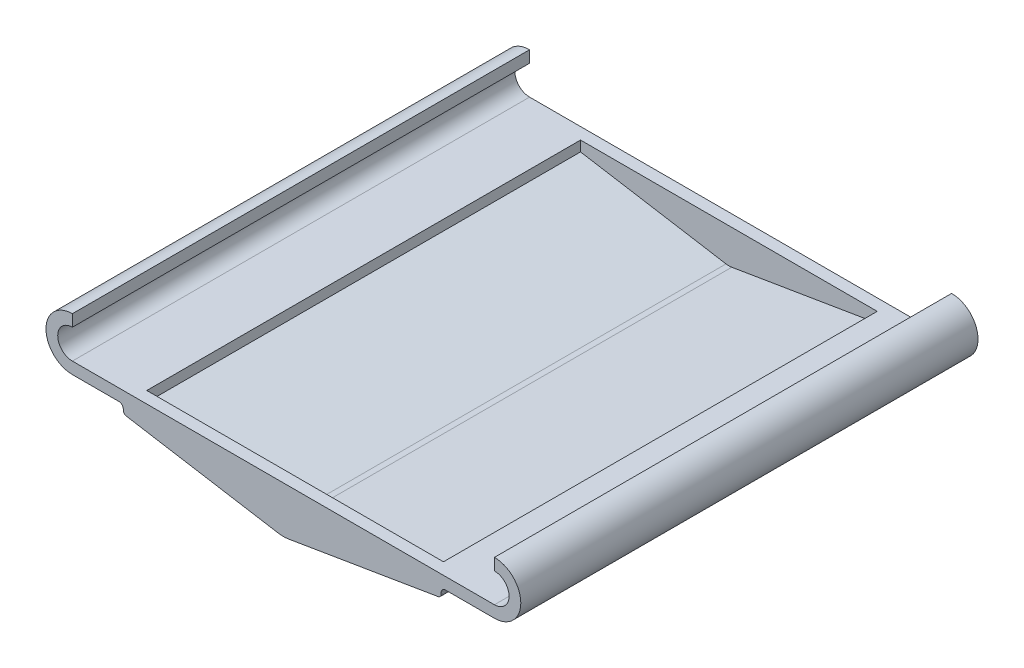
ISO-10303-21;
HEADER;
FILE_DESCRIPTION(('STEP AP214'),'2;1');
FILE_NAME('part.step','',(''),(''),'','','');
FILE_SCHEMA(('AUTOMOTIVE_DESIGN { 1 0 10303 214 1 1 1 1 }'));
ENDSEC;
DATA;
#1=APPLICATION_CONTEXT('core data for automotive mechanical design processes');
#2=APPLICATION_PROTOCOL_DEFINITION('international standard','automotive_design',2000,#1);
#3=PRODUCT_CONTEXT('',#1,'mechanical');
#4=PRODUCT('Part','Part','',(#3));
#5=PRODUCT_RELATED_PRODUCT_CATEGORY('part','',(#4));
#6=PRODUCT_DEFINITION_FORMATION('','',#4);
#7=PRODUCT_DEFINITION_CONTEXT('part definition',#1,'design');
#8=PRODUCT_DEFINITION('design','',#6,#7);
#9=PRODUCT_DEFINITION_SHAPE('','',#8);
#10=(LENGTH_UNIT() NAMED_UNIT(*) SI_UNIT(.MILLI.,.METRE.));
#11=(NAMED_UNIT(*) PLANE_ANGLE_UNIT() SI_UNIT($,.RADIAN.));
#12=(NAMED_UNIT(*) SI_UNIT($,.STERADIAN.) SOLID_ANGLE_UNIT());
#13=UNCERTAINTY_MEASURE_WITH_UNIT(LENGTH_MEASURE(1.E-05),#10,'distance_accuracy_value','');
#14=(GEOMETRIC_REPRESENTATION_CONTEXT(3) GLOBAL_UNCERTAINTY_ASSIGNED_CONTEXT((#13)) GLOBAL_UNIT_ASSIGNED_CONTEXT((#10,
#11,#12)) REPRESENTATION_CONTEXT('',''));
#15=CARTESIAN_POINT('',(0.,0.,0.));
#16=DIRECTION('',(0.,0.,1.));
#17=DIRECTION('',(1.,0.,0.));
#18=AXIS2_PLACEMENT_3D('',#15,#16,#17);
#19=CARTESIAN_POINT('',(-8.,-39.,19.5));
#20=DIRECTION('',(0.,-1.,0.));
#21=DIRECTION('',(1.,0.,0.));
#22=AXIS2_PLACEMENT_3D('',#19,#20,#21);
#23=PLANE('',#22);
#24=DIRECTION('',(-1.,0.,0.));
#25=VECTOR('',#24,1.);
#26=CARTESIAN_POINT('',(-8.,-39.,-19.4999999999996));
#27=LINE('',#26,#25);
#28=CARTESIAN_POINT('',(28.,-39.,-19.4999999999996));
#29=VERTEX_POINT('',#28);
#30=CARTESIAN_POINT('',(-8.,-39.,-19.4999999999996));
#31=VERTEX_POINT('',#30);
#32=EDGE_CURVE('E315',#29,#31,#27,.T.);
#33=ORIENTED_EDGE('',*,*,#32,.T.);
#34=DIRECTION('',(0.,0.,-1.));
#35=VECTOR('',#34,1.);
#36=CARTESIAN_POINT('',(-8.,-39.,19.5));
#37=LINE('',#36,#35);
#38=CARTESIAN_POINT('',(-8.,-39.,19.5));
#39=VERTEX_POINT('',#38);
#40=EDGE_CURVE('E336',#39,#31,#37,.T.);
#41=ORIENTED_EDGE('',*,*,#40,.F.);
#42=DIRECTION('',(-1.,0.,0.));
#43=VECTOR('',#42,1.);
#44=CARTESIAN_POINT('',(-8.,-39.,19.5));
#45=LINE('',#44,#43);
#46=CARTESIAN_POINT('',(28.,-39.,19.5));
#47=VERTEX_POINT('',#46);
#48=EDGE_CURVE('E334',#47,#39,#45,.T.);
#49=ORIENTED_EDGE('',*,*,#48,.F.);
#50=DIRECTION('',(0.,0.,-1.));
#51=VECTOR('',#50,1.);
#52=CARTESIAN_POINT('',(28.,-39.,19.5));
#53=LINE('',#52,#51);
#54=EDGE_CURVE('E339',#47,#29,#53,.T.);
#55=ORIENTED_EDGE('',*,*,#54,.T.);
#56=EDGE_LOOP('',(#33,#41,#49,#55));
#57=FACE_BOUND('',#56,.T.);
#58=DIRECTION('',(-1.,0.,0.));
#59=VECTOR('',#58,1.);
#60=CARTESIAN_POINT('',(22.6544570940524,-39.,-18.4999999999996));
#61=LINE('',#60,#59);
#62=CARTESIAN_POINT('',(22.6544570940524,-39.,-18.4999999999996));
#63=VERTEX_POINT('',#62);
#64=CARTESIAN_POINT('',(-2.65445709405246,-39.,-18.4999999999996));
#65=VERTEX_POINT('',#64);
#66=EDGE_CURVE('E224',#63,#65,#61,.T.);
#67=ORIENTED_EDGE('',*,*,#66,.F.);
#68=DIRECTION('',(0.,0.,1.));
#69=VECTOR('',#68,1.);
#70=CARTESIAN_POINT('',(22.6544570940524,-39.,-18.4999999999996));
#71=LINE('',#70,#69);
#72=CARTESIAN_POINT('',(22.6544570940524,-39.,18.5));
#73=VERTEX_POINT('',#72);
#74=EDGE_CURVE('E238',#63,#73,#71,.T.);
#75=ORIENTED_EDGE('',*,*,#74,.T.);
#76=DIRECTION('',(-1.,0.,0.));
#77=VECTOR('',#76,1.);
#78=CARTESIAN_POINT('',(22.6544570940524,-39.,18.5));
#79=LINE('',#78,#77);
#80=CARTESIAN_POINT('',(-2.65445709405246,-39.,18.5));
#81=VERTEX_POINT('',#80);
#82=EDGE_CURVE('E212',#73,#81,#79,.T.);
#83=ORIENTED_EDGE('',*,*,#82,.T.);
#84=DIRECTION('',(0.,0.,1.));
#85=VECTOR('',#84,1.);
#86=CARTESIAN_POINT('',(-2.65445709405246,-39.,-18.4999999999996));
#87=LINE('',#86,#85);
#88=EDGE_CURVE('E236',#65,#81,#87,.T.);
#89=ORIENTED_EDGE('',*,*,#88,.F.);
#90=EDGE_LOOP('',(#67,#75,#83,#89));
#91=FACE_BOUND('',#90,.T.);
#92=ADVANCED_FACE('F24',(#57,#91),#23,.F.);
#93=CARTESIAN_POINT('',(-8.,-40.,19.5));
#94=DIRECTION('',(0.,1.,0.));
#95=DIRECTION('',(-1.,0.,0.));
#96=AXIS2_PLACEMENT_3D('',#93,#94,#95);
#97=PLANE('',#96);
#98=DIRECTION('',(0.,0.,-1.));
#99=VECTOR('',#98,1.);
#100=CARTESIAN_POINT('',(-4.03413135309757,-40.,19.5));
#101=LINE('',#100,#99);
#102=CARTESIAN_POINT('',(-4.03413135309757,-40.,19.5));
#103=VERTEX_POINT('',#102);
#104=CARTESIAN_POINT('',(-4.03413135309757,-40.0000000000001,-19.4999999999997));
#105=VERTEX_POINT('',#104);
#106=EDGE_CURVE('E284',#103,#105,#101,.T.);
#107=ORIENTED_EDGE('',*,*,#106,.F.);
#108=DIRECTION('',(1.,0.,0.));
#109=VECTOR('',#108,1.);
#110=CARTESIAN_POINT('',(-8.,-40.,19.5));
#111=LINE('',#110,#109);
#112=CARTESIAN_POINT('',(-8.,-40.,19.5));
#113=VERTEX_POINT('',#112);
#114=EDGE_CURVE('E325',#113,#103,#111,.T.);
#115=ORIENTED_EDGE('',*,*,#114,.F.);
#116=DIRECTION('',(0.,0.,-1.));
#117=VECTOR('',#116,1.);
#118=CARTESIAN_POINT('',(-8.,-40.,19.5));
#119=LINE('',#118,#117);
#120=CARTESIAN_POINT('',(-8.,-40.0000000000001,-19.4999999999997));
#121=VERTEX_POINT('',#120);
#122=EDGE_CURVE('E351',#113,#121,#119,.T.);
#123=ORIENTED_EDGE('',*,*,#122,.T.);
#124=DIRECTION('',(1.,0.,0.));
#125=VECTOR('',#124,1.);
#126=CARTESIAN_POINT('',(-8.,-40.0000000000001,-19.4999999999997));
#127=LINE('',#126,#125);
#128=EDGE_CURVE('E307',#121,#105,#127,.T.);
#129=ORIENTED_EDGE('',*,*,#128,.T.);
#130=EDGE_LOOP('',(#107,#115,#123,#129));
#131=FACE_BOUND('',#130,.T.);
#132=ADVANCED_FACE('F435',(#131),#97,.F.);
#133=CARTESIAN_POINT('',(-8.,-37.7500000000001,19.5000000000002));
#134=DIRECTION('',(0.,0.,-1.));
#135=DIRECTION('',(-1.,0.,0.));
#136=AXIS2_PLACEMENT_3D('',#133,#134,#135);
#137=CYLINDRICAL_SURFACE('',#136,1.25);
#138=CARTESIAN_POINT('',(-8.,-37.75,-19.4999999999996));
#139=DIRECTION('',(0.,0.,-1.));
#140=DIRECTION('',(-1.,0.,0.));
#141=AXIS2_PLACEMENT_3D('',#138,#139,#140);
#142=CIRCLE('',#141,1.25);
#143=CARTESIAN_POINT('',(-8.,-36.5,-19.4999999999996));
#144=VERTEX_POINT('',#143);
#145=EDGE_CURVE('E299',#31,#144,#142,.T.);
#146=ORIENTED_EDGE('',*,*,#145,.T.);
#147=DIRECTION('',(0.,0.,-1.));
#148=VECTOR('',#147,1.);
#149=CARTESIAN_POINT('',(-8.,-36.5000000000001,19.5000000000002));
#150=LINE('',#149,#148);
#151=CARTESIAN_POINT('',(-8.,-36.5000000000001,19.5000000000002));
#152=VERTEX_POINT('',#151);
#153=EDGE_CURVE('E357',#152,#144,#150,.T.);
#154=ORIENTED_EDGE('',*,*,#153,.F.);
#155=CARTESIAN_POINT('',(-8.,-37.7500000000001,19.5000000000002));
#156=DIRECTION('',(0.,0.,-1.));
#157=DIRECTION('',(-1.,0.,0.));
#158=AXIS2_PLACEMENT_3D('',#155,#156,#157);
#159=CIRCLE('',#158,1.25);
#160=EDGE_CURVE('E317',#39,#152,#159,.T.);
#161=ORIENTED_EDGE('',*,*,#160,.F.);
#162=ORIENTED_EDGE('',*,*,#40,.T.);
#163=EDGE_LOOP('',(#146,#154,#161,#162));
#164=FACE_BOUND('',#163,.T.);
#165=ADVANCED_FACE('F26',(#164),#137,.F.);
#166=CARTESIAN_POINT('',(-8.,-36.5000000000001,19.5000000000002));
#167=DIRECTION('',(-1.,0.,0.));
#168=DIRECTION('',(0.,-1.,0.));
#169=AXIS2_PLACEMENT_3D('',#166,#167,#168);
#170=PLANE('',#169);
#171=DIRECTION('',(0.,1.,0.));
#172=VECTOR('',#171,1.);
#173=CARTESIAN_POINT('',(-8.,-36.5,-19.4999999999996));
#174=LINE('',#173,#172);
#175=CARTESIAN_POINT('',(-8.,-35.5,-19.4999999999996));
#176=VERTEX_POINT('',#175);
#177=EDGE_CURVE('E302',#144,#176,#174,.T.);
#178=ORIENTED_EDGE('',*,*,#177,.T.);
#179=DIRECTION('',(0.,0.,-1.));
#180=VECTOR('',#179,1.);
#181=CARTESIAN_POINT('',(-8.,-35.5,19.5000000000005));
#182=LINE('',#181,#180);
#183=CARTESIAN_POINT('',(-8.,-35.5,19.5000000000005));
#184=VERTEX_POINT('',#183);
#185=EDGE_CURVE('E354',#184,#176,#182,.T.);
#186=ORIENTED_EDGE('',*,*,#185,.F.);
#187=DIRECTION('',(0.,1.,0.));
#188=VECTOR('',#187,1.);
#189=CARTESIAN_POINT('',(-8.,-36.5000000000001,19.5000000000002));
#190=LINE('',#189,#188);
#191=EDGE_CURVE('E320',#152,#184,#190,.T.);
#192=ORIENTED_EDGE('',*,*,#191,.F.);
#193=ORIENTED_EDGE('',*,*,#153,.T.);
#194=EDGE_LOOP('',(#178,#186,#192,#193));
#195=FACE_BOUND('',#194,.T.);
#196=ADVANCED_FACE('F424',(#195),#170,.F.);
#197=CARTESIAN_POINT('',(-8.,-37.7500000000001,19.5000000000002));
#198=DIRECTION('',(0.,0.,-1.));
#199=DIRECTION('',(-1.,0.,0.));
#200=AXIS2_PLACEMENT_3D('',#197,#198,#199);
#201=CYLINDRICAL_SURFACE('',#200,2.25000000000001);
#202=CARTESIAN_POINT('',(-8.,-37.75,-19.4999999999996));
#203=DIRECTION('',(0.,0.,1.));
#204=DIRECTION('',(-1.,0.,0.));
#205=AXIS2_PLACEMENT_3D('',#202,#203,#204);
#206=CIRCLE('',#205,2.25000000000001);
#207=EDGE_CURVE('E304',#176,#121,#206,.T.);
#208=ORIENTED_EDGE('',*,*,#207,.T.);
#209=ORIENTED_EDGE('',*,*,#122,.F.);
#210=CARTESIAN_POINT('',(-8.,-37.7500000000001,19.5000000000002));
#211=DIRECTION('',(0.,0.,1.));
#212=DIRECTION('',(-1.,0.,0.));
#213=AXIS2_PLACEMENT_3D('',#210,#211,#212);
#214=CIRCLE('',#213,2.25000000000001);
#215=EDGE_CURVE('E322',#184,#113,#214,.T.);
#216=ORIENTED_EDGE('',*,*,#215,.F.);
#217=ORIENTED_EDGE('',*,*,#185,.T.);
#218=EDGE_LOOP('',(#208,#209,#216,#217));
#219=FACE_BOUND('',#218,.T.);
#220=ADVANCED_FACE('F431',(#219),#201,.T.);
#221=CARTESIAN_POINT('',(23.833284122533,-40.,19.5));
#222=VERTEX_POINT('',#221);
#223=CARTESIAN_POINT('',(28.,-40.,19.5));
#224=VERTEX_POINT('',#223);
#225=EDGE_CURVE('E324',#222,#224,#111,.T.);
#226=ORIENTED_EDGE('',*,*,#225,.F.);
#227=DIRECTION('',(0.,0.,-1.));
#228=VECTOR('',#227,1.);
#229=CARTESIAN_POINT('',(23.833284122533,-40.,19.5));
#230=LINE('',#229,#228);
#231=CARTESIAN_POINT('',(23.833284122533,-40.,-19.4999999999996));
#232=VERTEX_POINT('',#231);
#233=EDGE_CURVE('E287',#222,#232,#230,.T.);
#234=ORIENTED_EDGE('',*,*,#233,.T.);
#235=CARTESIAN_POINT('',(28.,-40.,-19.4999999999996));
#236=VERTEX_POINT('',#235);
#237=EDGE_CURVE('E306',#232,#236,#127,.T.);
#238=ORIENTED_EDGE('',*,*,#237,.T.);
#239=DIRECTION('',(0.,0.,-1.));
#240=VECTOR('',#239,1.);
#241=CARTESIAN_POINT('',(28.,-40.,19.5));
#242=LINE('',#241,#240);
#243=EDGE_CURVE('E348',#224,#236,#242,.T.);
#244=ORIENTED_EDGE('',*,*,#243,.F.);
#245=EDGE_LOOP('',(#226,#234,#238,#244));
#246=FACE_BOUND('',#245,.T.);
#247=ADVANCED_FACE('F397',(#246),#97,.F.);
#248=CARTESIAN_POINT('',(28.,-37.75,19.5000000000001));
#249=DIRECTION('',(0.,0.,-1.));
#250=DIRECTION('',(-1.,0.,0.));
#251=AXIS2_PLACEMENT_3D('',#248,#249,#250);
#252=CYLINDRICAL_SURFACE('',#251,2.25);
#253=CARTESIAN_POINT('',(28.,-37.75,-19.4999999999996));
#254=DIRECTION('',(0.,0.,1.));
#255=DIRECTION('',(1.,0.,0.));
#256=AXIS2_PLACEMENT_3D('',#253,#254,#255);
#257=CIRCLE('',#256,2.25);
#258=CARTESIAN_POINT('',(28.,-35.5000000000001,-19.4999999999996));
#259=VERTEX_POINT('',#258);
#260=EDGE_CURVE('E309',#236,#259,#257,.T.);
#261=ORIENTED_EDGE('',*,*,#260,.T.);
#262=DIRECTION('',(0.,0.,-1.));
#263=VECTOR('',#262,1.);
#264=CARTESIAN_POINT('',(28.,-35.5,19.5000000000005));
#265=LINE('',#264,#263);
#266=CARTESIAN_POINT('',(28.,-35.5,19.5000000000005));
#267=VERTEX_POINT('',#266);
#268=EDGE_CURVE('E345',#267,#259,#265,.T.);
#269=ORIENTED_EDGE('',*,*,#268,.F.);
#270=CARTESIAN_POINT('',(28.,-37.75,19.5000000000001));
#271=DIRECTION('',(0.,0.,1.));
#272=DIRECTION('',(1.,0.,0.));
#273=AXIS2_PLACEMENT_3D('',#270,#271,#272);
#274=CIRCLE('',#273,2.25);
#275=EDGE_CURVE('E328',#224,#267,#274,.T.);
#276=ORIENTED_EDGE('',*,*,#275,.F.);
#277=ORIENTED_EDGE('',*,*,#243,.T.);
#278=EDGE_LOOP('',(#261,#269,#276,#277));
#279=FACE_BOUND('',#278,.T.);
#280=ADVANCED_FACE('F404',(#279),#252,.T.);
#281=CARTESIAN_POINT('',(28.,-35.5,19.5000000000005));
#282=DIRECTION('',(1.,0.,0.));
#283=DIRECTION('',(0.,1.,0.));
#284=AXIS2_PLACEMENT_3D('',#281,#282,#283);
#285=PLANE('',#284);
#286=DIRECTION('',(0.,-1.,0.));
#287=VECTOR('',#286,1.);
#288=CARTESIAN_POINT('',(28.,-35.5000000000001,-19.4999999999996));
#289=LINE('',#288,#287);
#290=CARTESIAN_POINT('',(28.,-36.5,-19.4999999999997));
#291=VERTEX_POINT('',#290);
#292=EDGE_CURVE('E311',#259,#291,#289,.T.);
#293=ORIENTED_EDGE('',*,*,#292,.T.);
#294=DIRECTION('',(0.,0.,-1.));
#295=VECTOR('',#294,1.);
#296=CARTESIAN_POINT('',(28.,-36.5000000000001,19.5000000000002));
#297=LINE('',#296,#295);
#298=CARTESIAN_POINT('',(28.,-36.5000000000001,19.5000000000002));
#299=VERTEX_POINT('',#298);
#300=EDGE_CURVE('E342',#299,#291,#297,.T.);
#301=ORIENTED_EDGE('',*,*,#300,.F.);
#302=DIRECTION('',(0.,-1.,0.));
#303=VECTOR('',#302,1.);
#304=CARTESIAN_POINT('',(28.,-35.5,19.5000000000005));
#305=LINE('',#304,#303);
#306=EDGE_CURVE('E330',#267,#299,#305,.T.);
#307=ORIENTED_EDGE('',*,*,#306,.F.);
#308=ORIENTED_EDGE('',*,*,#268,.T.);
#309=EDGE_LOOP('',(#293,#301,#307,#308));
#310=FACE_BOUND('',#309,.T.);
#311=ADVANCED_FACE('F408',(#310),#285,.F.);
#312=CARTESIAN_POINT('',(28.,-37.75,19.5000000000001));
#313=DIRECTION('',(0.,0.,-1.));
#314=DIRECTION('',(-1.,0.,0.));
#315=AXIS2_PLACEMENT_3D('',#312,#313,#314);
#316=CYLINDRICAL_SURFACE('',#315,1.25);
#317=CARTESIAN_POINT('',(28.,-37.75,-19.4999999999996));
#318=DIRECTION('',(0.,0.,-1.));
#319=DIRECTION('',(1.,0.,0.));
#320=AXIS2_PLACEMENT_3D('',#317,#318,#319);
#321=CIRCLE('',#320,1.25);
#322=EDGE_CURVE('E313',#291,#29,#321,.T.);
#323=ORIENTED_EDGE('',*,*,#322,.T.);
#324=ORIENTED_EDGE('',*,*,#54,.F.);
#325=CARTESIAN_POINT('',(28.,-37.75,19.5000000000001));
#326=DIRECTION('',(0.,0.,-1.));
#327=DIRECTION('',(1.,0.,0.));
#328=AXIS2_PLACEMENT_3D('',#325,#326,#327);
#329=CIRCLE('',#328,1.25);
#330=EDGE_CURVE('E332',#299,#47,#329,.T.);
#331=ORIENTED_EDGE('',*,*,#330,.F.);
#332=ORIENTED_EDGE('',*,*,#300,.T.);
#333=EDGE_LOOP('',(#323,#324,#331,#332));
#334=FACE_BOUND('',#333,.T.);
#335=ADVANCED_FACE('F413',(#334),#316,.F.);
#336=CARTESIAN_POINT('',(-8.,-37.7500000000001,19.5000000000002));
#337=DIRECTION('',(0.,0.,-1.));
#338=DIRECTION('',(-1.,0.,0.));
#339=AXIS2_PLACEMENT_3D('',#336,#337,#338);
#340=PLANE('',#339);
#341=DIRECTION('',(0.986393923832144,-0.164398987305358,0.));
#342=VECTOR('',#341,1.);
#343=CARTESIAN_POINT('',(-3.40377679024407,-40.766037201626,19.5000000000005));
#344=LINE('',#343,#342);
#345=CARTESIAN_POINT('',(-3.40377679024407,-40.766037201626,19.5000000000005));
#346=VERTEX_POINT('',#345);
#347=CARTESIAN_POINT('',(9.58900253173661,-42.9315004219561,19.5000000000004));
#348=VERTEX_POINT('',#347);
#349=EDGE_CURVE('E258',#346,#348,#344,.T.);
#350=ORIENTED_EDGE('',*,*,#349,.T.);
#351=CARTESIAN_POINT('',(10.,-40.4655156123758,19.5000000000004));
#352=DIRECTION('',(0.,0.,-1.));
#353=DIRECTION('',(-1.,0.,0.));
#354=AXIS2_PLACEMENT_3D('',#351,#352,#353);
#355=CIRCLE('',#354,2.5);
#356=CARTESIAN_POINT('',(10.4109974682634,-42.9315004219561,19.5000000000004));
#357=VERTEX_POINT('',#356);
#358=EDGE_CURVE('E11',#348,#357,#355,.F.);
#359=ORIENTED_EDGE('',*,*,#358,.T.);
#360=DIRECTION('',(0.986393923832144,0.164398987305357,0.));
#361=VECTOR('',#360,1.);
#362=CARTESIAN_POINT('',(10.,-43.0000000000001,19.5000000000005));
#363=LINE('',#362,#361);
#364=CARTESIAN_POINT('',(23.2029295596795,-40.7995117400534,19.5000000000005));
#365=VERTEX_POINT('',#364);
#366=EDGE_CURVE('E260',#357,#365,#363,.T.);
#367=ORIENTED_EDGE('',*,*,#366,.T.);
#368=CARTESIAN_POINT('',(23.1536098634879,-40.5035935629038,19.5000000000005));
#369=DIRECTION('',(0.,0.,1.));
#370=DIRECTION('',(-1.,0.,0.));
#371=AXIS2_PLACEMENT_3D('',#368,#369,#370);
#372=CIRCLE('',#371,0.300000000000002);
#373=CARTESIAN_POINT('',(23.4536098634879,-40.5035935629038,19.5000000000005));
#374=VERTEX_POINT('',#373);
#375=EDGE_CURVE('E262',#365,#374,#372,.T.);
#376=ORIENTED_EDGE('',*,*,#375,.T.);
#377=DIRECTION('',(0.,1.,0.));
#378=VECTOR('',#377,1.);
#379=CARTESIAN_POINT('',(23.4536098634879,-40.3796742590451,19.5000000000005));
#380=LINE('',#379,#378);
#381=CARTESIAN_POINT('',(23.4536098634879,-40.3796742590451,19.5000000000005));
#382=VERTEX_POINT('',#381);
#383=EDGE_CURVE('E264',#374,#382,#380,.T.);
#384=ORIENTED_EDGE('',*,*,#383,.T.);
#385=CARTESIAN_POINT('',(23.833284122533,-40.3796742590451,19.5000000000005));
#386=DIRECTION('',(0.,0.,-1.));
#387=DIRECTION('',(-1.,0.,0.));
#388=AXIS2_PLACEMENT_3D('',#385,#386,#387);
#389=CIRCLE('',#388,0.379674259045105);
#390=EDGE_CURVE('E266',#382,#222,#389,.T.);
#391=ORIENTED_EDGE('',*,*,#390,.T.);
#392=ORIENTED_EDGE('',*,*,#225,.T.);
#393=ORIENTED_EDGE('',*,*,#275,.T.);
#394=ORIENTED_EDGE('',*,*,#306,.T.);
#395=ORIENTED_EDGE('',*,*,#330,.T.);
#396=ORIENTED_EDGE('',*,*,#48,.T.);
#397=ORIENTED_EDGE('',*,*,#160,.T.);
#398=ORIENTED_EDGE('',*,*,#191,.T.);
#399=ORIENTED_EDGE('',*,*,#215,.T.);
#400=ORIENTED_EDGE('',*,*,#114,.T.);
#401=CARTESIAN_POINT('',(-4.03413135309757,-40.3796742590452,19.5000000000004));
#402=DIRECTION('',(0.,0.,-1.));
#403=DIRECTION('',(1.,0.,0.));
#404=AXIS2_PLACEMENT_3D('',#401,#402,#403);
#405=CIRCLE('',#404,0.379674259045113);
#406=CARTESIAN_POINT('',(-3.65445709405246,-40.3796742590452,19.5000000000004));
#407=VERTEX_POINT('',#406);
#408=EDGE_CURVE('E269',#103,#407,#405,.T.);
#409=ORIENTED_EDGE('',*,*,#408,.T.);
#410=DIRECTION('',(0.,-1.,0.));
#411=VECTOR('',#410,1.);
#412=CARTESIAN_POINT('',(-3.65445709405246,-40.3796742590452,19.5000000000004));
#413=LINE('',#412,#411);
#414=CARTESIAN_POINT('',(-3.65445709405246,-40.4701190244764,19.5000000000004));
#415=VERTEX_POINT('',#414);
#416=EDGE_CURVE('E271',#407,#415,#413,.T.);
#417=ORIENTED_EDGE('',*,*,#416,.T.);
#418=CARTESIAN_POINT('',(-3.35445709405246,-40.4701190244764,19.5000000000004));
#419=DIRECTION('',(0.,0.,1.));
#420=DIRECTION('',(1.,0.,0.));
#421=AXIS2_PLACEMENT_3D('',#418,#419,#420);
#422=CIRCLE('',#421,0.299999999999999);
#423=EDGE_CURVE('E273',#415,#346,#422,.T.);
#424=ORIENTED_EDGE('',*,*,#423,.T.);
#425=EDGE_LOOP('',(#350,#359,#367,#376,#384,#391,#392,#393,#394,#395,#396,#397,#398,#399,#400,
#409,#417,#424));
#426=FACE_BOUND('',#425,.T.);
#427=ADVANCED_FACE('F378',(#426),#340,.F.);
#428=CARTESIAN_POINT('',(-8.,-37.75,-19.4999999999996));
#429=DIRECTION('',(0.,0.,-1.));
#430=DIRECTION('',(-1.,0.,0.));
#431=AXIS2_PLACEMENT_3D('',#428,#429,#430);
#432=PLANE('',#431);
#433=DIRECTION('',(0.986393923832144,0.164398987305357,0.));
#434=VECTOR('',#433,1.);
#435=CARTESIAN_POINT('',(10.,-43.0000000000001,-19.4999999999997));
#436=LINE('',#435,#434);
#437=CARTESIAN_POINT('',(10.4109974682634,-42.9315004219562,-19.4999999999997));
#438=VERTEX_POINT('',#437);
#439=CARTESIAN_POINT('',(23.2029295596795,-40.7995117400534,-19.4999999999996));
#440=VERTEX_POINT('',#439);
#441=EDGE_CURVE('E243',#438,#440,#436,.T.);
#442=ORIENTED_EDGE('',*,*,#441,.F.);
#443=CARTESIAN_POINT('',(10.,-40.4655156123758,-19.4999999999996));
#444=DIRECTION('',(0.,0.,-1.));
#445=DIRECTION('',(-1.,0.,0.));
#446=AXIS2_PLACEMENT_3D('',#443,#444,#445);
#447=CIRCLE('',#446,2.5);
#448=CARTESIAN_POINT('',(9.58900253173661,-42.9315004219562,-19.4999999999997));
#449=VERTEX_POINT('',#448);
#450=EDGE_CURVE('E363',#438,#449,#447,.T.);
#451=ORIENTED_EDGE('',*,*,#450,.T.);
#452=DIRECTION('',(0.986393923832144,-0.164398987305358,0.));
#453=VECTOR('',#452,1.);
#454=CARTESIAN_POINT('',(-3.40377679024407,-40.7660372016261,-19.4999999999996));
#455=LINE('',#454,#453);
#456=CARTESIAN_POINT('',(-3.40377679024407,-40.7660372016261,-19.4999999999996));
#457=VERTEX_POINT('',#456);
#458=EDGE_CURVE('E233',#457,#449,#455,.T.);
#459=ORIENTED_EDGE('',*,*,#458,.F.);
#460=CARTESIAN_POINT('',(-3.35445709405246,-40.4701190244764,-19.4999999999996));
#461=DIRECTION('',(0.,0.,1.));
#462=DIRECTION('',(1.,0.,0.));
#463=AXIS2_PLACEMENT_3D('',#460,#461,#462);
#464=CIRCLE('',#463,0.299999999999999);
#465=CARTESIAN_POINT('',(-3.65445709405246,-40.4701190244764,-19.4999999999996));
#466=VERTEX_POINT('',#465);
#467=EDGE_CURVE('E256',#466,#457,#464,.T.);
#468=ORIENTED_EDGE('',*,*,#467,.F.);
#469=DIRECTION('',(0.,-1.,0.));
#470=VECTOR('',#469,1.);
#471=CARTESIAN_POINT('',(-3.65445709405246,-40.3796742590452,-19.4999999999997));
#472=LINE('',#471,#470);
#473=CARTESIAN_POINT('',(-3.65445709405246,-40.3796742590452,-19.4999999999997));
#474=VERTEX_POINT('',#473);
#475=EDGE_CURVE('E254',#474,#466,#472,.T.);
#476=ORIENTED_EDGE('',*,*,#475,.F.);
#477=CARTESIAN_POINT('',(-4.03413135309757,-40.3796742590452,-19.4999999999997));
#478=DIRECTION('',(0.,0.,-1.));
#479=DIRECTION('',(1.,0.,0.));
#480=AXIS2_PLACEMENT_3D('',#477,#478,#479);
#481=CIRCLE('',#480,0.379674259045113);
#482=EDGE_CURVE('E252',#105,#474,#481,.T.);
#483=ORIENTED_EDGE('',*,*,#482,.F.);
#484=ORIENTED_EDGE('',*,*,#128,.F.);
#485=ORIENTED_EDGE('',*,*,#207,.F.);
#486=ORIENTED_EDGE('',*,*,#177,.F.);
#487=ORIENTED_EDGE('',*,*,#145,.F.);
#488=ORIENTED_EDGE('',*,*,#32,.F.);
#489=ORIENTED_EDGE('',*,*,#322,.F.);
#490=ORIENTED_EDGE('',*,*,#292,.F.);
#491=ORIENTED_EDGE('',*,*,#260,.F.);
#492=ORIENTED_EDGE('',*,*,#237,.F.);
#493=CARTESIAN_POINT('',(23.833284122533,-40.3796742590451,-19.4999999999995));
#494=DIRECTION('',(0.,0.,-1.));
#495=DIRECTION('',(-1.,0.,0.));
#496=AXIS2_PLACEMENT_3D('',#493,#494,#495);
#497=CIRCLE('',#496,0.379674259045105);
#498=CARTESIAN_POINT('',(23.4536098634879,-40.3796742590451,-19.4999999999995));
#499=VERTEX_POINT('',#498);
#500=EDGE_CURVE('E249',#499,#232,#497,.T.);
#501=ORIENTED_EDGE('',*,*,#500,.F.);
#502=DIRECTION('',(0.,1.,0.));
#503=VECTOR('',#502,1.);
#504=CARTESIAN_POINT('',(23.4536098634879,-40.3796742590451,-19.4999999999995));
#505=LINE('',#504,#503);
#506=CARTESIAN_POINT('',(23.4536098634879,-40.5035935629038,-19.4999999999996));
#507=VERTEX_POINT('',#506);
#508=EDGE_CURVE('E247',#507,#499,#505,.T.);
#509=ORIENTED_EDGE('',*,*,#508,.F.);
#510=CARTESIAN_POINT('',(23.1536098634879,-40.5035935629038,-19.4999999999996));
#511=DIRECTION('',(0.,0.,1.));
#512=DIRECTION('',(-1.,0.,0.));
#513=AXIS2_PLACEMENT_3D('',#510,#511,#512);
#514=CIRCLE('',#513,0.300000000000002);
#515=EDGE_CURVE('E245',#440,#507,#514,.T.);
#516=ORIENTED_EDGE('',*,*,#515,.F.);
#517=EDGE_LOOP('',(#442,#451,#459,#468,#476,#483,#484,#485,#486,#487,#488,#489,#490,#491,#492,
#501,#509,#516));
#518=FACE_BOUND('',#517,.T.);
#519=ADVANCED_FACE('F367',(#518),#432,.T.);
#520=CARTESIAN_POINT('',(-3.40377679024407,-40.766037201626,19.5000000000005));
#521=DIRECTION('',(0.164398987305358,0.986393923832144,0.));
#522=DIRECTION('',(-0.986393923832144,0.164398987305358,0.));
#523=AXIS2_PLACEMENT_3D('',#520,#521,#522);
#524=PLANE('',#523);
#525=ORIENTED_EDGE('',*,*,#458,.T.);
#526=DIRECTION('',(0.,0.,-1.));
#527=VECTOR('',#526,1.);
#528=CARTESIAN_POINT('',(9.58900253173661,-42.9315004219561,19.5000000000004));
#529=LINE('',#528,#527);
#530=EDGE_CURVE('E32',#449,#348,#529,.F.);
#531=ORIENTED_EDGE('',*,*,#530,.T.);
#532=ORIENTED_EDGE('',*,*,#349,.F.);
#533=DIRECTION('',(0.,0.,-1.));
#534=VECTOR('',#533,1.);
#535=CARTESIAN_POINT('',(-3.40377679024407,-40.766037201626,19.5000000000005));
#536=LINE('',#535,#534);
#537=EDGE_CURVE('E275',#346,#457,#536,.T.);
#538=ORIENTED_EDGE('',*,*,#537,.T.);
#539=EDGE_LOOP('',(#525,#531,#532,#538));
#540=FACE_BOUND('',#539,.T.);
#541=ADVANCED_FACE('F372',(#540),#524,.F.);
#542=CARTESIAN_POINT('',(10.,-43.0000000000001,19.5000000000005));
#543=DIRECTION('',(-0.164398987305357,0.986393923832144,0.));
#544=DIRECTION('',(-0.986393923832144,-0.164398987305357,0.));
#545=AXIS2_PLACEMENT_3D('',#542,#543,#544);
#546=PLANE('',#545);
#547=ORIENTED_EDGE('',*,*,#366,.F.);
#548=DIRECTION('',(0.,0.,-1.));
#549=VECTOR('',#548,1.);
#550=CARTESIAN_POINT('',(10.4109974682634,-42.9315004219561,19.5000000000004));
#551=LINE('',#550,#549);
#552=EDGE_CURVE('E360',#357,#438,#551,.T.);
#553=ORIENTED_EDGE('',*,*,#552,.T.);
#554=ORIENTED_EDGE('',*,*,#441,.T.);
#555=DIRECTION('',(0.,0.,-1.));
#556=VECTOR('',#555,1.);
#557=CARTESIAN_POINT('',(23.2029295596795,-40.7995117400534,19.5000000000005));
#558=LINE('',#557,#556);
#559=EDGE_CURVE('E296',#365,#440,#558,.T.);
#560=ORIENTED_EDGE('',*,*,#559,.F.);
#561=EDGE_LOOP('',(#547,#553,#554,#560));
#562=FACE_BOUND('',#561,.T.);
#563=ADVANCED_FACE('F381',(#562),#546,.F.);
#564=CARTESIAN_POINT('',(23.1536098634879,-40.5035935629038,19.5000000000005));
#565=DIRECTION('',(0.,0.,-1.));
#566=DIRECTION('',(-1.,0.,0.));
#567=AXIS2_PLACEMENT_3D('',#564,#565,#566);
#568=CYLINDRICAL_SURFACE('',#567,0.300000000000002);
#569=ORIENTED_EDGE('',*,*,#515,.T.);
#570=DIRECTION('',(0.,0.,-1.));
#571=VECTOR('',#570,1.);
#572=CARTESIAN_POINT('',(23.4536098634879,-40.5035935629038,19.5000000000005));
#573=LINE('',#572,#571);
#574=EDGE_CURVE('E293',#374,#507,#573,.T.);
#575=ORIENTED_EDGE('',*,*,#574,.F.);
#576=ORIENTED_EDGE('',*,*,#375,.F.);
#577=ORIENTED_EDGE('',*,*,#559,.T.);
#578=EDGE_LOOP('',(#569,#575,#576,#577));
#579=FACE_BOUND('',#578,.T.);
#580=ADVANCED_FACE('F385',(#579),#568,.T.);
#581=CARTESIAN_POINT('',(23.4536098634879,-40.3796742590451,19.5000000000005));
#582=DIRECTION('',(-1.,0.,0.));
#583=DIRECTION('',(0.,-1.,0.));
#584=AXIS2_PLACEMENT_3D('',#581,#582,#583);
#585=PLANE('',#584);
#586=ORIENTED_EDGE('',*,*,#508,.T.);
#587=DIRECTION('',(0.,0.,-1.));
#588=VECTOR('',#587,1.);
#589=CARTESIAN_POINT('',(23.4536098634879,-40.3796742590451,19.5000000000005));
#590=LINE('',#589,#588);
#591=EDGE_CURVE('E290',#382,#499,#590,.T.);
#592=ORIENTED_EDGE('',*,*,#591,.F.);
#593=ORIENTED_EDGE('',*,*,#383,.F.);
#594=ORIENTED_EDGE('',*,*,#574,.T.);
#595=EDGE_LOOP('',(#586,#592,#593,#594));
#596=FACE_BOUND('',#595,.T.);
#597=ADVANCED_FACE('F391',(#596),#585,.F.);
#598=CARTESIAN_POINT('',(23.833284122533,-40.3796742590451,19.5000000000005));
#599=DIRECTION('',(0.,0.,-1.));
#600=DIRECTION('',(-1.,0.,0.));
#601=AXIS2_PLACEMENT_3D('',#598,#599,#600);
#602=CYLINDRICAL_SURFACE('',#601,0.379674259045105);
#603=ORIENTED_EDGE('',*,*,#500,.T.);
#604=ORIENTED_EDGE('',*,*,#233,.F.);
#605=ORIENTED_EDGE('',*,*,#390,.F.);
#606=ORIENTED_EDGE('',*,*,#591,.T.);
#607=EDGE_LOOP('',(#603,#604,#605,#606));
#608=FACE_BOUND('',#607,.T.);
#609=ADVANCED_FACE('F395',(#608),#602,.F.);
#610=CARTESIAN_POINT('',(-4.03413135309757,-40.3796742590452,19.5000000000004));
#611=DIRECTION('',(0.,0.,-1.));
#612=DIRECTION('',(-1.,0.,0.));
#613=AXIS2_PLACEMENT_3D('',#610,#611,#612);
#614=CYLINDRICAL_SURFACE('',#613,0.379674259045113);
#615=ORIENTED_EDGE('',*,*,#482,.T.);
#616=DIRECTION('',(0.,0.,-1.));
#617=VECTOR('',#616,1.);
#618=CARTESIAN_POINT('',(-3.65445709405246,-40.3796742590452,19.5000000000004));
#619=LINE('',#618,#617);
#620=EDGE_CURVE('E281',#407,#474,#619,.T.);
#621=ORIENTED_EDGE('',*,*,#620,.F.);
#622=ORIENTED_EDGE('',*,*,#408,.F.);
#623=ORIENTED_EDGE('',*,*,#106,.T.);
#624=EDGE_LOOP('',(#615,#621,#622,#623));
#625=FACE_BOUND('',#624,.T.);
#626=ADVANCED_FACE('F438',(#625),#614,.F.);
#627=CARTESIAN_POINT('',(-3.65445709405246,-40.3796742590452,19.5000000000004));
#628=DIRECTION('',(1.,0.,0.));
#629=DIRECTION('',(0.,1.,0.));
#630=AXIS2_PLACEMENT_3D('',#627,#628,#629);
#631=PLANE('',#630);
#632=ORIENTED_EDGE('',*,*,#475,.T.);
#633=DIRECTION('',(0.,0.,-1.));
#634=VECTOR('',#633,1.);
#635=CARTESIAN_POINT('',(-3.65445709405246,-40.4701190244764,19.5000000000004));
#636=LINE('',#635,#634);
#637=EDGE_CURVE('E278',#415,#466,#636,.T.);
#638=ORIENTED_EDGE('',*,*,#637,.F.);
#639=ORIENTED_EDGE('',*,*,#416,.F.);
#640=ORIENTED_EDGE('',*,*,#620,.T.);
#641=EDGE_LOOP('',(#632,#638,#639,#640));
#642=FACE_BOUND('',#641,.T.);
#643=ADVANCED_FACE('F443',(#642),#631,.F.);
#644=CARTESIAN_POINT('',(-3.35445709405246,-40.4701190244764,19.5000000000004));
#645=DIRECTION('',(0.,0.,-1.));
#646=DIRECTION('',(-1.,0.,0.));
#647=AXIS2_PLACEMENT_3D('',#644,#645,#646);
#648=CYLINDRICAL_SURFACE('',#647,0.299999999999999);
#649=ORIENTED_EDGE('',*,*,#467,.T.);
#650=ORIENTED_EDGE('',*,*,#537,.F.);
#651=ORIENTED_EDGE('',*,*,#423,.F.);
#652=ORIENTED_EDGE('',*,*,#637,.T.);
#653=EDGE_LOOP('',(#649,#650,#651,#652));
#654=FACE_BOUND('',#653,.T.);
#655=ADVANCED_FACE('F447',(#654),#648,.T.);
#656=CARTESIAN_POINT('',(10.,-40.4655156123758,19.5000000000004));
#657=DIRECTION('',(0.,0.,-1.));
#658=DIRECTION('',(-1.,0.,0.));
#659=AXIS2_PLACEMENT_3D('',#656,#657,#658);
#660=CYLINDRICAL_SURFACE('',#659,2.5);
#661=ORIENTED_EDGE('',*,*,#358,.F.);
#662=ORIENTED_EDGE('',*,*,#530,.F.);
#663=ORIENTED_EDGE('',*,*,#450,.F.);
#664=ORIENTED_EDGE('',*,*,#552,.F.);
#665=EDGE_LOOP('',(#661,#662,#663,#664));
#666=FACE_BOUND('',#665,.T.);
#667=ADVANCED_FACE('F375',(#666),#660,.T.);
#668=CARTESIAN_POINT('',(10.,-40.4655156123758,-18.4999999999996));
#669=DIRECTION('',(0.,0.,1.));
#670=DIRECTION('',(1.,0.,0.));
#671=AXIS2_PLACEMENT_3D('',#668,#669,#670);
#672=CYLINDRICAL_SURFACE('',#671,1.5);
#673=CARTESIAN_POINT('',(10.,-40.4655156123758,18.5000000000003));
#674=DIRECTION('',(0.,0.,1.));
#675=DIRECTION('',(1.,0.,0.));
#676=AXIS2_PLACEMENT_3D('',#673,#674,#675);
#677=CIRCLE('',#676,1.5);
#678=CARTESIAN_POINT('',(9.75340151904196,-41.945106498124,18.5000000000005));
#679=VERTEX_POINT('',#678);
#680=CARTESIAN_POINT('',(10.246598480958,-41.945106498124,18.5000000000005));
#681=VERTEX_POINT('',#680);
#682=EDGE_CURVE('E202',#679,#681,#677,.T.);
#683=ORIENTED_EDGE('',*,*,#682,.T.);
#684=DIRECTION('',(0.,0.,1.));
#685=VECTOR('',#684,1.);
#686=CARTESIAN_POINT('',(10.246598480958,-41.945106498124,-18.4999999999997));
#687=LINE('',#686,#685);
#688=CARTESIAN_POINT('',(10.246598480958,-41.945106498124,-18.4999999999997));
#689=VERTEX_POINT('',#688);
#690=EDGE_CURVE('E186',#689,#681,#687,.T.);
#691=ORIENTED_EDGE('',*,*,#690,.F.);
#692=CARTESIAN_POINT('',(10.,-40.4655156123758,-18.4999999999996));
#693=DIRECTION('',(0.,0.,1.));
#694=DIRECTION('',(1.,0.,0.));
#695=AXIS2_PLACEMENT_3D('',#692,#693,#694);
#696=CIRCLE('',#695,1.5);
#697=CARTESIAN_POINT('',(9.75340151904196,-41.945106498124,-18.4999999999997));
#698=VERTEX_POINT('',#697);
#699=EDGE_CURVE('E218',#698,#689,#696,.T.);
#700=ORIENTED_EDGE('',*,*,#699,.F.);
#701=DIRECTION('',(0.,0.,1.));
#702=VECTOR('',#701,1.);
#703=CARTESIAN_POINT('',(9.75340151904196,-41.945106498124,-18.4999999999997));
#704=LINE('',#703,#702);
#705=EDGE_CURVE('E208',#698,#679,#704,.T.);
#706=ORIENTED_EDGE('',*,*,#705,.T.);
#707=EDGE_LOOP('',(#683,#691,#700,#706));
#708=FACE_BOUND('',#707,.T.);
#709=ADVANCED_FACE('F207',(#708),#672,.F.);
#710=CARTESIAN_POINT('',(9.75340151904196,-41.945106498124,-18.4999999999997));
#711=DIRECTION('',(-0.164398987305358,-0.986393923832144,0.));
#712=DIRECTION('',(0.986393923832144,-0.164398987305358,0.));
#713=AXIS2_PLACEMENT_3D('',#710,#711,#712);
#714=PLANE('',#713);
#715=DIRECTION('',(0.986393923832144,-0.164398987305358,0.));
#716=VECTOR('',#715,1.);
#717=CARTESIAN_POINT('',(9.75340151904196,-41.945106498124,18.5000000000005));
#718=LINE('',#717,#716);
#719=CARTESIAN_POINT('',(-2.65445709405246,-39.8771300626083,18.5));
#720=VERTEX_POINT('',#719);
#721=EDGE_CURVE('E216',#720,#679,#718,.T.);
#722=ORIENTED_EDGE('',*,*,#721,.T.);
#723=ORIENTED_EDGE('',*,*,#705,.F.);
#724=DIRECTION('',(0.986393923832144,-0.164398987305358,0.));
#725=VECTOR('',#724,1.);
#726=CARTESIAN_POINT('',(9.75340151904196,-41.945106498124,-18.4999999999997));
#727=LINE('',#726,#725);
#728=CARTESIAN_POINT('',(-2.65445709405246,-39.8771300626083,-18.4999999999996));
#729=VERTEX_POINT('',#728);
#730=EDGE_CURVE('E197',#729,#698,#727,.T.);
#731=ORIENTED_EDGE('',*,*,#730,.F.);
#732=DIRECTION('',(0.,0.,1.));
#733=VECTOR('',#732,1.);
#734=CARTESIAN_POINT('',(-2.65445709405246,-39.8771300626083,-18.4999999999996));
#735=LINE('',#734,#733);
#736=EDGE_CURVE('E234',#729,#720,#735,.T.);
#737=ORIENTED_EDGE('',*,*,#736,.T.);
#738=EDGE_LOOP('',(#722,#723,#731,#737));
#739=FACE_BOUND('',#738,.T.);
#740=ADVANCED_FACE('F556',(#739),#714,.F.);
#741=CARTESIAN_POINT('',(-2.65445709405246,-39.,-18.4999999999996));
#742=DIRECTION('',(-1.,0.,0.));
#743=DIRECTION('',(0.,-1.,0.));
#744=AXIS2_PLACEMENT_3D('',#741,#742,#743);
#745=PLANE('',#744);
#746=DIRECTION('',(0.,-1.,0.));
#747=VECTOR('',#746,1.);
#748=CARTESIAN_POINT('',(-2.65445709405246,-39.,18.5));
#749=LINE('',#748,#747);
#750=EDGE_CURVE('E39',#81,#720,#749,.T.);
#751=ORIENTED_EDGE('',*,*,#750,.T.);
#752=ORIENTED_EDGE('',*,*,#736,.F.);
#753=DIRECTION('',(0.,-1.,0.));
#754=VECTOR('',#753,1.);
#755=CARTESIAN_POINT('',(-2.65445709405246,-39.,-18.4999999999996));
#756=LINE('',#755,#754);
#757=EDGE_CURVE('E227',#65,#729,#756,.T.);
#758=ORIENTED_EDGE('',*,*,#757,.F.);
#759=ORIENTED_EDGE('',*,*,#88,.T.);
#760=EDGE_LOOP('',(#751,#752,#758,#759));
#761=FACE_BOUND('',#760,.T.);
#762=ADVANCED_FACE('F563',(#761),#745,.F.);
#763=CARTESIAN_POINT('',(22.6544570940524,-39.,-18.4999999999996));
#764=DIRECTION('',(1.,0.,0.));
#765=DIRECTION('',(0.,0.,-1.));
#766=AXIS2_PLACEMENT_3D('',#763,#764,#765);
#767=PLANE('',#766);
#768=DIRECTION('',(0.,1.,0.));
#769=VECTOR('',#768,1.);
#770=CARTESIAN_POINT('',(22.6544570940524,-39.,18.5));
#771=LINE('',#770,#769);
#772=CARTESIAN_POINT('',(22.6544570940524,-39.8771300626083,18.5));
#773=VERTEX_POINT('',#772);
#774=EDGE_CURVE('E205',#773,#73,#771,.T.);
#775=ORIENTED_EDGE('',*,*,#774,.T.);
#776=ORIENTED_EDGE('',*,*,#74,.F.);
#777=DIRECTION('',(0.,1.,0.));
#778=VECTOR('',#777,1.);
#779=CARTESIAN_POINT('',(22.6544570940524,-39.,-18.4999999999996));
#780=LINE('',#779,#778);
#781=CARTESIAN_POINT('',(22.6544570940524,-39.8771300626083,-18.4999999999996));
#782=VERTEX_POINT('',#781);
#783=EDGE_CURVE('E221',#782,#63,#780,.T.);
#784=ORIENTED_EDGE('',*,*,#783,.F.);
#785=DIRECTION('',(0.,0.,1.));
#786=VECTOR('',#785,1.);
#787=CARTESIAN_POINT('',(22.6544570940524,-39.8771300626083,-18.4999999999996));
#788=LINE('',#787,#786);
#789=EDGE_CURVE('E196',#782,#773,#788,.T.);
#790=ORIENTED_EDGE('',*,*,#789,.T.);
#791=EDGE_LOOP('',(#775,#776,#784,#790));
#792=FACE_BOUND('',#791,.T.);
#793=ADVANCED_FACE('F571',(#792),#767,.F.);
#794=CARTESIAN_POINT('',(10.246598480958,-41.945106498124,-18.4999999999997));
#795=DIRECTION('',(0.164398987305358,-0.986393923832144,0.));
#796=DIRECTION('',(0.986393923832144,0.164398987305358,0.));
#797=AXIS2_PLACEMENT_3D('',#794,#795,#796);
#798=PLANE('',#797);
#799=DIRECTION('',(0.986393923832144,0.164398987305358,0.));
#800=VECTOR('',#799,1.);
#801=CARTESIAN_POINT('',(10.246598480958,-41.945106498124,18.5000000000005));
#802=LINE('',#801,#800);
#803=EDGE_CURVE('E189',#681,#773,#802,.T.);
#804=ORIENTED_EDGE('',*,*,#803,.T.);
#805=ORIENTED_EDGE('',*,*,#789,.F.);
#806=DIRECTION('',(0.986393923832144,0.164398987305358,0.));
#807=VECTOR('',#806,1.);
#808=CARTESIAN_POINT('',(10.246598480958,-41.945106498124,-18.4999999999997));
#809=LINE('',#808,#807);
#810=EDGE_CURVE('E191',#689,#782,#809,.T.);
#811=ORIENTED_EDGE('',*,*,#810,.F.);
#812=ORIENTED_EDGE('',*,*,#690,.T.);
#813=EDGE_LOOP('',(#804,#805,#811,#812));
#814=FACE_BOUND('',#813,.T.);
#815=ADVANCED_FACE('F188',(#814),#798,.F.);
#816=CARTESIAN_POINT('',(10.,-40.4655156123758,-18.4999999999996));
#817=DIRECTION('',(0.,0.,1.));
#818=DIRECTION('',(1.,0.,0.));
#819=AXIS2_PLACEMENT_3D('',#816,#817,#818);
#820=PLANE('',#819);
#821=ORIENTED_EDGE('',*,*,#699,.T.);
#822=ORIENTED_EDGE('',*,*,#810,.T.);
#823=ORIENTED_EDGE('',*,*,#783,.T.);
#824=ORIENTED_EDGE('',*,*,#66,.T.);
#825=ORIENTED_EDGE('',*,*,#757,.T.);
#826=ORIENTED_EDGE('',*,*,#730,.T.);
#827=EDGE_LOOP('',(#821,#822,#823,#824,#825,#826));
#828=FACE_BOUND('',#827,.T.);
#829=ADVANCED_FACE('F586',(#828),#820,.T.);
#830=CARTESIAN_POINT('',(10.,-40.4655156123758,18.5000000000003));
#831=DIRECTION('',(0.,0.,1.));
#832=DIRECTION('',(1.,0.,0.));
#833=AXIS2_PLACEMENT_3D('',#830,#831,#832);
#834=PLANE('',#833);
#835=ORIENTED_EDGE('',*,*,#682,.F.);
#836=ORIENTED_EDGE('',*,*,#721,.F.);
#837=ORIENTED_EDGE('',*,*,#750,.F.);
#838=ORIENTED_EDGE('',*,*,#82,.F.);
#839=ORIENTED_EDGE('',*,*,#774,.F.);
#840=ORIENTED_EDGE('',*,*,#803,.F.);
#841=EDGE_LOOP('',(#835,#836,#837,#838,#839,#840));
#842=FACE_BOUND('',#841,.T.);
#843=ADVANCED_FACE('F201',(#842),#834,.F.);
#844=CLOSED_SHELL('',(#92,#132,#165,#196,#220,#247,#280,#311,#335,#427,#519,#541,#563,#580,#597,
#609,#626,#643,#655,#667,#709,#740,#762,#793,#815,#829,#843));
#845=MANIFOLD_SOLID_BREP('B2',#844);
#846=ADVANCED_BREP_SHAPE_REPRESENTATION('',(#18,#845),#14);
#847=SHAPE_DEFINITION_REPRESENTATION(#9,#846);
ENDSEC;
END-ISO-10303-21;
